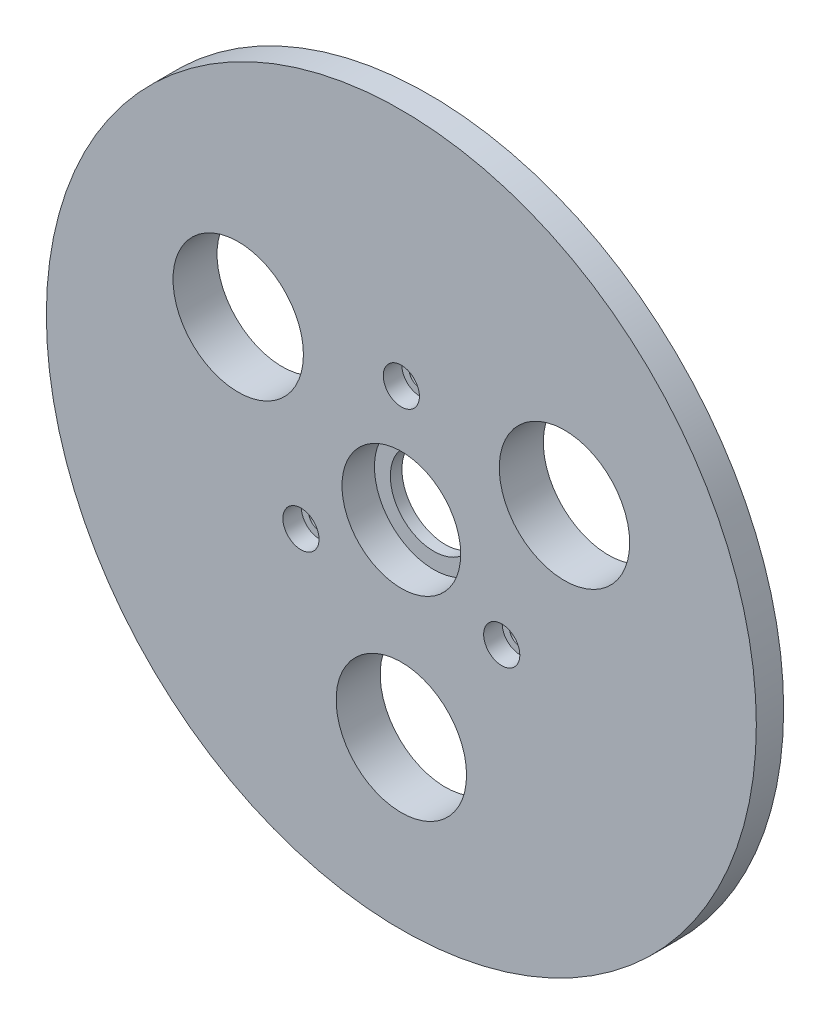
from build123d import *

# Parameters (mm, degrees)
SKETCH2_R           = 77.7875
SKETCH2_R_2         = 9.525
SKETCH2_R_3         = 2.3876
BOSS_EXTRUDE1_DEPTH = 9.652
SKETCH3_R           = 13.0048
CUT_EXTRUDE1_DEPTH  = 7.112
SKETCH4_R           = 3.9624
CUT_EXTRUDE2_DEPTH  = 4.064
CHAMFER1_SIZE       = 6.35
CHAMFER1_SIZE2      = 3.666174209
SKETCH5_R           = 14.2875
CUT_EXTRUDE3_DEPTH  = 25.4


with BuildPart() as part:
    # Sketch2 → Boss-Extrude1 (new body)
    with BuildSketch(Plane.XY):
        Circle(SKETCH2_R)
        Circle(SKETCH2_R_2, mode=Mode.SUBTRACT)
        with Locations((-21.997045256, -12.7)):
            Circle(SKETCH2_R_3, mode=Mode.SUBTRACT)
        with Locations((21.997045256, -12.7)):
            Circle(SKETCH2_R_3, mode=Mode.SUBTRACT)
        with Locations((0, 25.4)):
            Circle(SKETCH2_R_3, mode=Mode.SUBTRACT)
    extrude(amount=BOSS_EXTRUDE1_DEPTH)

    # Sketch3 → Cut-Extrude1 (cut)
    with BuildSketch(Plane.XY.offset(9.652)):
        Circle(SKETCH3_R)
    extrude(amount=-CUT_EXTRUDE1_DEPTH, mode=Mode.SUBTRACT)

    # Sketch4 → Cut-Extrude2 (cut)
    with BuildSketch(Plane.XY.offset(9.652)):
        with Locations((-21.997045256, -12.7)):
            Circle(SKETCH4_R)
        with Locations((21.997045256, -12.7)):
            Circle(SKETCH4_R)
        with Locations((0, 25.4)):
            Circle(SKETCH4_R)
    extrude(amount=-CUT_EXTRUDE2_DEPTH, mode=Mode.SUBTRACT)

    # Chamfer1
    chamfer1_edges = [part.edges().sort_by_distance(p)[0] for p in [
        (-77.7875, 0, 0),
    ]]
    chamfer1_side = [part.faces().sort_by_distance(p)[0] for p in [
        (-75.58733725, 0, 0),
    ]]
    chamfer(chamfer1_edges, length=CHAMFER1_SIZE, length2=CHAMFER1_SIZE2, reference=chamfer1_side[0])

    # Sketch5 → Cut-Extrude3 (cut)
    with BuildSketch(Plane.XY):
        with Locations((0, -41.275)):
            Circle(SKETCH5_R)
        with Locations((35.745198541, 20.6375)):
            Circle(SKETCH5_R)
        with Locations((-35.745198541, 20.6375)):
            Circle(SKETCH5_R)
    extrude(amount=CUT_EXTRUDE3_DEPTH, mode=Mode.SUBTRACT)


solid = part.part
